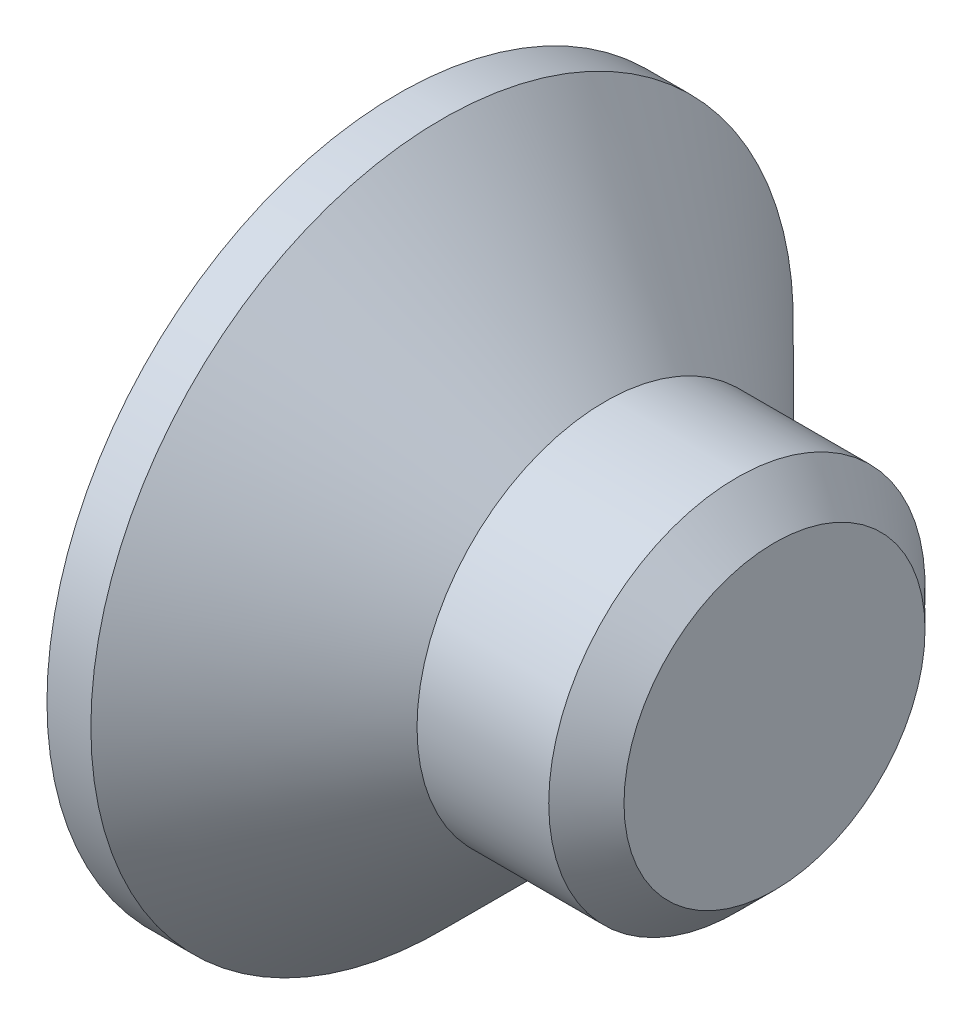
ISO-10303-21;
HEADER;
FILE_DESCRIPTION(('STEP AP214'),'2;1');
FILE_NAME('part.step','',(''),(''),'','','');
FILE_SCHEMA(('AUTOMOTIVE_DESIGN { 1 0 10303 214 1 1 1 1 }'));
ENDSEC;
DATA;
#1=APPLICATION_CONTEXT('core data for automotive mechanical design processes');
#2=APPLICATION_PROTOCOL_DEFINITION('international standard','automotive_design',2000,#1);
#3=PRODUCT_CONTEXT('',#1,'mechanical');
#4=PRODUCT('Part','Part','',(#3));
#5=PRODUCT_RELATED_PRODUCT_CATEGORY('part','',(#4));
#6=PRODUCT_DEFINITION_FORMATION('','',#4);
#7=PRODUCT_DEFINITION_CONTEXT('part definition',#1,'design');
#8=PRODUCT_DEFINITION('design','',#6,#7);
#9=PRODUCT_DEFINITION_SHAPE('','',#8);
#10=(LENGTH_UNIT() NAMED_UNIT(*) SI_UNIT(.MILLI.,.METRE.));
#11=(NAMED_UNIT(*) PLANE_ANGLE_UNIT() SI_UNIT($,.RADIAN.));
#12=(NAMED_UNIT(*) SI_UNIT($,.STERADIAN.) SOLID_ANGLE_UNIT());
#13=UNCERTAINTY_MEASURE_WITH_UNIT(LENGTH_MEASURE(1.E-05),#10,'distance_accuracy_value','');
#14=(GEOMETRIC_REPRESENTATION_CONTEXT(3) GLOBAL_UNCERTAINTY_ASSIGNED_CONTEXT((#13)) GLOBAL_UNIT_ASSIGNED_CONTEXT((#10,
#11,#12)) REPRESENTATION_CONTEXT('',''));
#15=CARTESIAN_POINT('',(0.,0.,0.));
#16=DIRECTION('',(0.,0.,1.));
#17=DIRECTION('',(1.,0.,0.));
#18=AXIS2_PLACEMENT_3D('',#15,#16,#17);
#19=CARTESIAN_POINT('',(0.,0.,0.));
#20=DIRECTION('',(-1.,0.,0.));
#21=DIRECTION('',(0.,0.,1.));
#22=AXIS2_PLACEMENT_3D('',#19,#20,#21);
#23=CONICAL_SURFACE('',#22,1.5,0.78539816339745);
#24=CARTESIAN_POINT('',(-1.3,0.,0.));
#25=DIRECTION('',(-1.,0.,0.));
#26=DIRECTION('',(0.,0.,1.));
#27=AXIS2_PLACEMENT_3D('',#24,#25,#26);
#28=CIRCLE('',#27,2.8);
#29=CARTESIAN_POINT('',(-1.3,0.,2.8));
#30=VERTEX_POINT('',#29);
#31=EDGE_CURVE('E189',#30,#30,#28,.T.);
#32=ORIENTED_EDGE('',*,*,#31,.F.);
#33=EDGE_LOOP('',(#32));
#34=FACE_BOUND('',#33,.T.);
#35=CARTESIAN_POINT('',(0.,0.,0.));
#36=DIRECTION('',(-1.,0.,0.));
#37=DIRECTION('',(0.,0.,1.));
#38=AXIS2_PLACEMENT_3D('',#35,#36,#37);
#39=CIRCLE('',#38,1.5);
#40=CARTESIAN_POINT('',(0.,0.,1.5));
#41=VERTEX_POINT('',#40);
#42=EDGE_CURVE('E212',#41,#41,#39,.T.);
#43=ORIENTED_EDGE('',*,*,#42,.T.);
#44=EDGE_LOOP('',(#43));
#45=FACE_BOUND('',#44,.T.);
#46=ADVANCED_FACE('F33',(#34,#45),#23,.T.);
#47=CARTESIAN_POINT('',(-1.65,0.,0.));
#48=DIRECTION('',(-1.,0.,0.));
#49=DIRECTION('',(0.,0.,1.));
#50=AXIS2_PLACEMENT_3D('',#47,#48,#49);
#51=CYLINDRICAL_SURFACE('',#50,1.5);
#52=CARTESIAN_POINT('',(1.05,0.,0.));
#53=DIRECTION('',(-1.,0.,0.));
#54=DIRECTION('',(0.,0.,1.));
#55=AXIS2_PLACEMENT_3D('',#52,#53,#54);
#56=CIRCLE('',#55,1.5);
#57=CARTESIAN_POINT('',(1.05,0.,1.5));
#58=VERTEX_POINT('',#57);
#59=EDGE_CURVE('E41',#58,#58,#56,.T.);
#60=ORIENTED_EDGE('',*,*,#59,.T.);
#61=EDGE_LOOP('',(#60));
#62=FACE_BOUND('',#61,.T.);
#63=ORIENTED_EDGE('',*,*,#42,.F.);
#64=EDGE_LOOP('',(#63));
#65=FACE_BOUND('',#64,.T.);
#66=ADVANCED_FACE('F217',(#62,#65),#51,.T.);
#67=CARTESIAN_POINT('',(1.35,0.,0.));
#68=DIRECTION('',(-1.,0.,0.));
#69=DIRECTION('',(0.,0.,1.));
#70=AXIS2_PLACEMENT_3D('',#67,#68,#69);
#71=PLANE('',#70);
#72=CARTESIAN_POINT('',(1.35,0.,0.));
#73=DIRECTION('',(-1.,0.,0.));
#74=DIRECTION('',(0.,0.,1.));
#75=AXIS2_PLACEMENT_3D('',#72,#73,#74);
#76=CIRCLE('',#75,1.2);
#77=CARTESIAN_POINT('',(1.35,0.,1.2));
#78=VERTEX_POINT('',#77);
#79=EDGE_CURVE('E11',#78,#78,#76,.F.);
#80=ORIENTED_EDGE('',*,*,#79,.T.);
#81=EDGE_LOOP('',(#80));
#82=FACE_BOUND('',#81,.T.);
#83=ADVANCED_FACE('F239',(#82),#71,.F.);
#84=CARTESIAN_POINT('',(-1.65,2.8,0.));
#85=DIRECTION('',(1.,0.,0.));
#86=DIRECTION('',(0.,0.,-1.));
#87=AXIS2_PLACEMENT_3D('',#84,#85,#86);
#88=PLANE('',#87);
#89=DIRECTION('',(0.,0.,-1.));
#90=VECTOR('',#89,1.);
#91=CARTESIAN_POINT('',(-1.65,0.365,-1.45));
#92=LINE('',#91,#90);
#93=CARTESIAN_POINT('',(-1.65,0.365,-0.365));
#94=VERTEX_POINT('',#93);
#95=CARTESIAN_POINT('',(-1.65,0.365,-1.45));
#96=VERTEX_POINT('',#95);
#97=EDGE_CURVE('E158',#94,#96,#92,.T.);
#98=ORIENTED_EDGE('',*,*,#97,.F.);
#99=DIRECTION('',(0.,-1.,0.));
#100=VECTOR('',#99,1.);
#101=CARTESIAN_POINT('',(-1.65,0.365,-0.365));
#102=LINE('',#101,#100);
#103=CARTESIAN_POINT('',(-1.65,1.45,-0.365));
#104=VERTEX_POINT('',#103);
#105=EDGE_CURVE('E48',#104,#94,#102,.T.);
#106=ORIENTED_EDGE('',*,*,#105,.F.);
#107=DIRECTION('',(0.,0.,-1.));
#108=VECTOR('',#107,1.);
#109=CARTESIAN_POINT('',(-1.65,1.45,-0.365));
#110=LINE('',#109,#108);
#111=CARTESIAN_POINT('',(-1.65,1.45,0.365));
#112=VERTEX_POINT('',#111);
#113=EDGE_CURVE('E185',#112,#104,#110,.T.);
#114=ORIENTED_EDGE('',*,*,#113,.F.);
#115=DIRECTION('',(0.,1.,0.));
#116=VECTOR('',#115,1.);
#117=CARTESIAN_POINT('',(-1.65,1.45,0.365));
#118=LINE('',#117,#116);
#119=CARTESIAN_POINT('',(-1.65,0.365,0.365));
#120=VERTEX_POINT('',#119);
#121=EDGE_CURVE('E183',#120,#112,#118,.T.);
#122=ORIENTED_EDGE('',*,*,#121,.F.);
#123=DIRECTION('',(0.,0.,-1.));
#124=VECTOR('',#123,1.);
#125=CARTESIAN_POINT('',(-1.65,0.365,0.365));
#126=LINE('',#125,#124);
#127=CARTESIAN_POINT('',(-1.65,0.365,1.45));
#128=VERTEX_POINT('',#127);
#129=EDGE_CURVE('E132',#128,#120,#126,.T.);
#130=ORIENTED_EDGE('',*,*,#129,.F.);
#131=DIRECTION('',(0.,1.,0.));
#132=VECTOR('',#131,1.);
#133=CARTESIAN_POINT('',(-1.65,0.365,1.45));
#134=LINE('',#133,#132);
#135=CARTESIAN_POINT('',(-1.65,-0.365,1.45));
#136=VERTEX_POINT('',#135);
#137=EDGE_CURVE('E179',#136,#128,#134,.T.);
#138=ORIENTED_EDGE('',*,*,#137,.F.);
#139=DIRECTION('',(0.,0.,1.));
#140=VECTOR('',#139,1.);
#141=CARTESIAN_POINT('',(-1.65,-0.365,1.45));
#142=LINE('',#141,#140);
#143=CARTESIAN_POINT('',(-1.65,-0.365,0.365));
#144=VERTEX_POINT('',#143);
#145=EDGE_CURVE('E176',#144,#136,#142,.T.);
#146=ORIENTED_EDGE('',*,*,#145,.F.);
#147=DIRECTION('',(0.,1.,0.));
#148=VECTOR('',#147,1.);
#149=CARTESIAN_POINT('',(-1.65,-0.365,0.365));
#150=LINE('',#149,#148);
#151=CARTESIAN_POINT('',(-1.65,-1.45,0.365));
#152=VERTEX_POINT('',#151);
#153=EDGE_CURVE('E173',#152,#144,#150,.T.);
#154=ORIENTED_EDGE('',*,*,#153,.F.);
#155=DIRECTION('',(0.,0.,1.));
#156=VECTOR('',#155,1.);
#157=CARTESIAN_POINT('',(-1.65,-1.45,0.365));
#158=LINE('',#157,#156);
#159=CARTESIAN_POINT('',(-1.65,-1.45,-0.365));
#160=VERTEX_POINT('',#159);
#161=EDGE_CURVE('E170',#160,#152,#158,.T.);
#162=ORIENTED_EDGE('',*,*,#161,.F.);
#163=DIRECTION('',(0.,-1.,0.));
#164=VECTOR('',#163,1.);
#165=CARTESIAN_POINT('',(-1.65,-1.45,-0.365));
#166=LINE('',#165,#164);
#167=CARTESIAN_POINT('',(-1.65,-0.365,-0.365));
#168=VERTEX_POINT('',#167);
#169=EDGE_CURVE('E167',#168,#160,#166,.T.);
#170=ORIENTED_EDGE('',*,*,#169,.F.);
#171=DIRECTION('',(0.,0.,1.));
#172=VECTOR('',#171,1.);
#173=CARTESIAN_POINT('',(-1.65,-0.365,-0.365));
#174=LINE('',#173,#172);
#175=CARTESIAN_POINT('',(-1.65,-0.365,-1.45));
#176=VERTEX_POINT('',#175);
#177=EDGE_CURVE('E164',#176,#168,#174,.T.);
#178=ORIENTED_EDGE('',*,*,#177,.F.);
#179=DIRECTION('',(0.,-1.,0.));
#180=VECTOR('',#179,1.);
#181=CARTESIAN_POINT('',(-1.65,-0.365,-1.45));
#182=LINE('',#181,#180);
#183=EDGE_CURVE('E161',#96,#176,#182,.T.);
#184=ORIENTED_EDGE('',*,*,#183,.F.);
#185=EDGE_LOOP('',(#98,#106,#114,#122,#130,#138,#146,#154,#162,#170,#178,#184));
#186=FACE_BOUND('',#185,.T.);
#187=CARTESIAN_POINT('',(-1.65,0.,0.));
#188=DIRECTION('',(-1.,0.,0.));
#189=DIRECTION('',(0.,0.,1.));
#190=AXIS2_PLACEMENT_3D('',#187,#188,#189);
#191=CIRCLE('',#190,2.8);
#192=CARTESIAN_POINT('',(-1.65,0.,2.8));
#193=VERTEX_POINT('',#192);
#194=EDGE_CURVE('E209',#193,#193,#191,.T.);
#195=ORIENTED_EDGE('',*,*,#194,.T.);
#196=EDGE_LOOP('',(#195));
#197=FACE_BOUND('',#196,.T.);
#198=ADVANCED_FACE('F230',(#186,#197),#88,.F.);
#199=CARTESIAN_POINT('',(-1.65,0.,0.));
#200=DIRECTION('',(-1.,0.,0.));
#201=DIRECTION('',(0.,0.,1.));
#202=AXIS2_PLACEMENT_3D('',#199,#200,#201);
#203=CYLINDRICAL_SURFACE('',#202,2.8);
#204=ORIENTED_EDGE('',*,*,#194,.F.);
#205=EDGE_LOOP('',(#204));
#206=FACE_BOUND('',#205,.T.);
#207=ORIENTED_EDGE('',*,*,#31,.T.);
#208=EDGE_LOOP('',(#207));
#209=FACE_BOUND('',#208,.T.);
#210=ADVANCED_FACE('F222',(#206,#209),#203,.T.);
#211=CARTESIAN_POINT('',(1.05,0.,0.));
#212=DIRECTION('',(-1.,0.,0.));
#213=DIRECTION('',(0.,0.,1.));
#214=AXIS2_PLACEMENT_3D('',#211,#212,#213);
#215=CONICAL_SURFACE('',#214,1.5,0.78539816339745);
#216=CARTESIAN_POINT('',(1.35,0.,1.2));
#217=CARTESIAN_POINT('',(1.346875,0.,1.203125));
#218=CARTESIAN_POINT('',(1.34375,0.,1.20625));
#219=CARTESIAN_POINT('',(1.3375,0.,1.2125));
#220=CARTESIAN_POINT('',(1.334375,0.,1.215625));
#221=CARTESIAN_POINT('',(1.328125,0.,1.221875));
#222=CARTESIAN_POINT('',(1.325,0.,1.225));
#223=CARTESIAN_POINT('',(1.31875,0.,1.23125));
#224=CARTESIAN_POINT('',(1.315625,0.,1.234375));
#225=CARTESIAN_POINT('',(1.309375,0.,1.240625));
#226=CARTESIAN_POINT('',(1.30625,0.,1.24375));
#227=CARTESIAN_POINT('',(1.3,0.,1.25));
#228=CARTESIAN_POINT('',(1.296875,0.,1.253125));
#229=CARTESIAN_POINT('',(1.290625,0.,1.259375));
#230=CARTESIAN_POINT('',(1.2875,0.,1.2625));
#231=CARTESIAN_POINT('',(1.28125,0.,1.26875));
#232=CARTESIAN_POINT('',(1.278125,0.,1.271875));
#233=CARTESIAN_POINT('',(1.271875,0.,1.278125));
#234=CARTESIAN_POINT('',(1.26875,0.,1.28125));
#235=CARTESIAN_POINT('',(1.2625,0.,1.2875));
#236=CARTESIAN_POINT('',(1.259375,0.,1.290625));
#237=CARTESIAN_POINT('',(1.253125,0.,1.296875));
#238=CARTESIAN_POINT('',(1.25,0.,1.3));
#239=CARTESIAN_POINT('',(1.24375,0.,1.30625));
#240=CARTESIAN_POINT('',(1.240625,0.,1.309375));
#241=CARTESIAN_POINT('',(1.234375,0.,1.315625));
#242=CARTESIAN_POINT('',(1.23125,0.,1.31875));
#243=CARTESIAN_POINT('',(1.225,0.,1.325));
#244=CARTESIAN_POINT('',(1.221875,0.,1.328125));
#245=CARTESIAN_POINT('',(1.215625,0.,1.334375));
#246=CARTESIAN_POINT('',(1.2125,0.,1.3375));
#247=CARTESIAN_POINT('',(1.20625,0.,1.34375));
#248=CARTESIAN_POINT('',(1.203125,0.,1.346875));
#249=CARTESIAN_POINT('',(1.196875,0.,1.353125));
#250=CARTESIAN_POINT('',(1.19375,0.,1.35625));
#251=CARTESIAN_POINT('',(1.1875,0.,1.3625));
#252=CARTESIAN_POINT('',(1.184375,0.,1.365625));
#253=CARTESIAN_POINT('',(1.178125,0.,1.371875));
#254=CARTESIAN_POINT('',(1.175,0.,1.375));
#255=CARTESIAN_POINT('',(1.16875,0.,1.38125));
#256=CARTESIAN_POINT('',(1.165625,0.,1.384375));
#257=CARTESIAN_POINT('',(1.159375,0.,1.390625));
#258=CARTESIAN_POINT('',(1.15625,0.,1.39375));
#259=CARTESIAN_POINT('',(1.15,0.,1.4));
#260=CARTESIAN_POINT('',(1.146875,0.,1.403125));
#261=CARTESIAN_POINT('',(1.140625,0.,1.409375));
#262=CARTESIAN_POINT('',(1.1375,0.,1.4125));
#263=CARTESIAN_POINT('',(1.13125,0.,1.41875));
#264=CARTESIAN_POINT('',(1.128125,0.,1.421875));
#265=CARTESIAN_POINT('',(1.121875,0.,1.428125));
#266=CARTESIAN_POINT('',(1.11875,0.,1.43125));
#267=CARTESIAN_POINT('',(1.1125,0.,1.4375));
#268=CARTESIAN_POINT('',(1.109375,0.,1.440625));
#269=CARTESIAN_POINT('',(1.103125,0.,1.446875));
#270=CARTESIAN_POINT('',(1.1,0.,1.45));
#271=CARTESIAN_POINT('',(1.09375,0.,1.45625));
#272=CARTESIAN_POINT('',(1.090625,0.,1.459375));
#273=CARTESIAN_POINT('',(1.084375,0.,1.465625));
#274=CARTESIAN_POINT('',(1.08125,0.,1.46875));
#275=CARTESIAN_POINT('',(1.075,0.,1.475));
#276=CARTESIAN_POINT('',(1.071875,0.,1.478125));
#277=CARTESIAN_POINT('',(1.065625,0.,1.484375));
#278=CARTESIAN_POINT('',(1.0625,0.,1.4875));
#279=CARTESIAN_POINT('',(1.05625,0.,1.49375));
#280=CARTESIAN_POINT('',(1.053125,0.,1.496875));
#281=CARTESIAN_POINT('',(1.05,0.,1.5));
#282=B_SPLINE_CURVE_WITH_KNOTS('',3,(#216,#217,#218,#219,#220,#221,#222,#223,#224,#225,#226,
#227,#228,#229,#230,#231,#232,#233,#234,#235,#236,#237,#238,#239,#240,#241,#242,#243,#244,#245,
#246,#247,#248,#249,#250,#251,#252,#253,#254,#255,#256,#257,#258,#259,#260,#261,#262,#263,#264,
#265,#266,#267,#268,#269,#270,#271,#272,#273,#274,#275,#276,#277,#278,#279,#280,#281),
.UNSPECIFIED.,.F.,.F.,(4,2,2,2,2,2,2,2,2,2,2,2,2,2,2,2,2,2,2,2,2,2,2,2,2,2,2,2,2,2,2,2,4),(0.,
0.0132582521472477,0.0265165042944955,0.0397747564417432,0.053033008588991,0.0662912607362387,
0.0795495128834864,0.0928077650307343,0.106066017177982,0.11932426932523,0.132582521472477,
0.145840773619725,0.159099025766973,0.17235727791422,0.185615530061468,0.198873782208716,
0.212132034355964,0.225390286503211,0.238648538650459,0.251906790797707,0.265165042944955,
0.278423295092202,0.29168154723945,0.304939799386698,0.318198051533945,0.331456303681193,
0.344714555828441,0.357972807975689,0.371231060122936,0.384489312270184,0.397747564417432,
0.411005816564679,0.424264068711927),.UNSPECIFIED.);
#283=EDGE_CURVE('BSEAM35',#78,#58,#282,.T.);
#284=ORIENTED_EDGE('',*,*,#79,.F.);
#285=ORIENTED_EDGE('',*,*,#59,.F.);
#286=ORIENTED_EDGE('',*,*,#283,.T.);
#287=ORIENTED_EDGE('',*,*,#283,.F.);
#288=EDGE_LOOP('',(#284,#286,#285,#287));
#289=FACE_BOUND('',#288,.T.);
#290=ADVANCED_FACE('F35',(#289),#215,.T.);
#291=CARTESIAN_POINT('',(-0.4,0.365,-0.365));
#292=DIRECTION('',(0.,0.,-1.));
#293=DIRECTION('',(-1.,0.,0.));
#294=AXIS2_PLACEMENT_3D('',#291,#292,#293);
#295=PLANE('',#294);
#296=ORIENTED_EDGE('',*,*,#105,.T.);
#297=DIRECTION('',(-1.,0.,0.));
#298=VECTOR('',#297,1.);
#299=CARTESIAN_POINT('',(-0.4,0.365,-0.365));
#300=LINE('',#299,#298);
#301=CARTESIAN_POINT('',(-0.4,0.365,-0.365));
#302=VERTEX_POINT('',#301);
#303=EDGE_CURVE('E96',#302,#94,#300,.T.);
#304=ORIENTED_EDGE('',*,*,#303,.F.);
#305=DIRECTION('',(0.,-1.,0.));
#306=VECTOR('',#305,1.);
#307=CARTESIAN_POINT('',(-0.4,0.365,-0.365));
#308=LINE('',#307,#306);
#309=CARTESIAN_POINT('',(-0.4,1.45,-0.365));
#310=VERTEX_POINT('',#309);
#311=EDGE_CURVE('E187',#310,#302,#308,.T.);
#312=ORIENTED_EDGE('',*,*,#311,.F.);
#313=DIRECTION('',(-1.,0.,0.));
#314=VECTOR('',#313,1.);
#315=CARTESIAN_POINT('',(-0.4,1.45,-0.365));
#316=LINE('',#315,#314);
#317=EDGE_CURVE('E56',#310,#104,#316,.T.);
#318=ORIENTED_EDGE('',*,*,#317,.T.);
#319=EDGE_LOOP('',(#296,#304,#312,#318));
#320=FACE_BOUND('',#319,.T.);
#321=ADVANCED_FACE('F221',(#320),#295,.F.);
#322=CARTESIAN_POINT('',(-0.4,1.45,-0.365));
#323=DIRECTION('',(0.,1.,0.));
#324=DIRECTION('',(-1.,0.,0.));
#325=AXIS2_PLACEMENT_3D('',#322,#323,#324);
#326=PLANE('',#325);
#327=ORIENTED_EDGE('',*,*,#113,.T.);
#328=ORIENTED_EDGE('',*,*,#317,.F.);
#329=DIRECTION('',(0.,0.,-1.));
#330=VECTOR('',#329,1.);
#331=CARTESIAN_POINT('',(-0.4,1.45,-0.365));
#332=LINE('',#331,#330);
#333=CARTESIAN_POINT('',(-0.4,1.45,0.365));
#334=VERTEX_POINT('',#333);
#335=EDGE_CURVE('E144',#334,#310,#332,.T.);
#336=ORIENTED_EDGE('',*,*,#335,.F.);
#337=DIRECTION('',(-1.,0.,0.));
#338=VECTOR('',#337,1.);
#339=CARTESIAN_POINT('',(-0.4,1.45,0.365));
#340=LINE('',#339,#338);
#341=EDGE_CURVE('E136',#334,#112,#340,.T.);
#342=ORIENTED_EDGE('',*,*,#341,.T.);
#343=EDGE_LOOP('',(#327,#328,#336,#342));
#344=FACE_BOUND('',#343,.T.);
#345=ADVANCED_FACE('F228',(#344),#326,.F.);
#346=CARTESIAN_POINT('',(-0.4,1.45,0.365));
#347=DIRECTION('',(0.,0.,1.));
#348=DIRECTION('',(1.,0.,0.));
#349=AXIS2_PLACEMENT_3D('',#346,#347,#348);
#350=PLANE('',#349);
#351=ORIENTED_EDGE('',*,*,#121,.T.);
#352=ORIENTED_EDGE('',*,*,#341,.F.);
#353=DIRECTION('',(0.,1.,0.));
#354=VECTOR('',#353,1.);
#355=CARTESIAN_POINT('',(-0.4,1.45,0.365));
#356=LINE('',#355,#354);
#357=CARTESIAN_POINT('',(-0.4,0.365,0.365));
#358=VERTEX_POINT('',#357);
#359=EDGE_CURVE('E140',#358,#334,#356,.T.);
#360=ORIENTED_EDGE('',*,*,#359,.F.);
#361=DIRECTION('',(-1.,0.,0.));
#362=VECTOR('',#361,1.);
#363=CARTESIAN_POINT('',(-0.4,0.365,0.365));
#364=LINE('',#363,#362);
#365=EDGE_CURVE('E125',#358,#120,#364,.T.);
#366=ORIENTED_EDGE('',*,*,#365,.T.);
#367=EDGE_LOOP('',(#351,#352,#360,#366));
#368=FACE_BOUND('',#367,.T.);
#369=ADVANCED_FACE('F141',(#368),#350,.F.);
#370=CARTESIAN_POINT('',(-0.4,0.365,0.365));
#371=DIRECTION('',(0.,1.,0.));
#372=DIRECTION('',(-1.,0.,0.));
#373=AXIS2_PLACEMENT_3D('',#370,#371,#372);
#374=PLANE('',#373);
#375=ORIENTED_EDGE('',*,*,#129,.T.);
#376=ORIENTED_EDGE('',*,*,#365,.F.);
#377=DIRECTION('',(0.,0.,-1.));
#378=VECTOR('',#377,1.);
#379=CARTESIAN_POINT('',(-0.4,0.365,0.365));
#380=LINE('',#379,#378);
#381=CARTESIAN_POINT('',(-0.4,0.365,1.45));
#382=VERTEX_POINT('',#381);
#383=EDGE_CURVE('E129',#382,#358,#380,.T.);
#384=ORIENTED_EDGE('',*,*,#383,.F.);
#385=DIRECTION('',(-1.,0.,0.));
#386=VECTOR('',#385,1.);
#387=CARTESIAN_POINT('',(-0.4,0.365,1.45));
#388=LINE('',#387,#386);
#389=EDGE_CURVE('E137',#382,#128,#388,.T.);
#390=ORIENTED_EDGE('',*,*,#389,.T.);
#391=EDGE_LOOP('',(#375,#376,#384,#390));
#392=FACE_BOUND('',#391,.T.);
#393=ADVANCED_FACE('F127',(#392),#374,.F.);
#394=CARTESIAN_POINT('',(-0.4,0.365,1.45));
#395=DIRECTION('',(0.,0.,1.));
#396=DIRECTION('',(1.,0.,0.));
#397=AXIS2_PLACEMENT_3D('',#394,#395,#396);
#398=PLANE('',#397);
#399=ORIENTED_EDGE('',*,*,#137,.T.);
#400=ORIENTED_EDGE('',*,*,#389,.F.);
#401=DIRECTION('',(0.,1.,0.));
#402=VECTOR('',#401,1.);
#403=CARTESIAN_POINT('',(-0.4,0.365,1.45));
#404=LINE('',#403,#402);
#405=CARTESIAN_POINT('',(-0.4,-0.365,1.45));
#406=VERTEX_POINT('',#405);
#407=EDGE_CURVE('E150',#406,#382,#404,.T.);
#408=ORIENTED_EDGE('',*,*,#407,.F.);
#409=DIRECTION('',(-1.,0.,0.));
#410=VECTOR('',#409,1.);
#411=CARTESIAN_POINT('',(-0.4,-0.365,1.45));
#412=LINE('',#411,#410);
#413=EDGE_CURVE('E192',#406,#136,#412,.T.);
#414=ORIENTED_EDGE('',*,*,#413,.T.);
#415=EDGE_LOOP('',(#399,#400,#408,#414));
#416=FACE_BOUND('',#415,.T.);
#417=ADVANCED_FACE('F277',(#416),#398,.F.);
#418=CARTESIAN_POINT('',(-0.4,-0.365,1.45));
#419=DIRECTION('',(0.,-1.,0.));
#420=DIRECTION('',(1.,0.,0.));
#421=AXIS2_PLACEMENT_3D('',#418,#419,#420);
#422=PLANE('',#421);
#423=ORIENTED_EDGE('',*,*,#145,.T.);
#424=ORIENTED_EDGE('',*,*,#413,.F.);
#425=DIRECTION('',(0.,0.,1.));
#426=VECTOR('',#425,1.);
#427=CARTESIAN_POINT('',(-0.4,-0.365,1.45));
#428=LINE('',#427,#426);
#429=CARTESIAN_POINT('',(-0.4,-0.365,0.365));
#430=VERTEX_POINT('',#429);
#431=EDGE_CURVE('E152',#430,#406,#428,.T.);
#432=ORIENTED_EDGE('',*,*,#431,.F.);
#433=DIRECTION('',(-1.,0.,0.));
#434=VECTOR('',#433,1.);
#435=CARTESIAN_POINT('',(-0.4,-0.365,0.365));
#436=LINE('',#435,#434);
#437=EDGE_CURVE('E194',#430,#144,#436,.T.);
#438=ORIENTED_EDGE('',*,*,#437,.T.);
#439=EDGE_LOOP('',(#423,#424,#432,#438));
#440=FACE_BOUND('',#439,.T.);
#441=ADVANCED_FACE('F273',(#440),#422,.F.);
#442=CARTESIAN_POINT('',(-0.4,-0.365,0.365));
#443=DIRECTION('',(0.,0.,1.));
#444=DIRECTION('',(1.,0.,0.));
#445=AXIS2_PLACEMENT_3D('',#442,#443,#444);
#446=PLANE('',#445);
#447=ORIENTED_EDGE('',*,*,#153,.T.);
#448=ORIENTED_EDGE('',*,*,#437,.F.);
#449=DIRECTION('',(0.,1.,0.));
#450=VECTOR('',#449,1.);
#451=CARTESIAN_POINT('',(-0.4,-0.365,0.365));
#452=LINE('',#451,#450);
#453=CARTESIAN_POINT('',(-0.4,-1.45,0.365));
#454=VERTEX_POINT('',#453);
#455=EDGE_CURVE('E422',#454,#430,#452,.T.);
#456=ORIENTED_EDGE('',*,*,#455,.F.);
#457=DIRECTION('',(-1.,0.,0.));
#458=VECTOR('',#457,1.);
#459=CARTESIAN_POINT('',(-0.4,-1.45,0.365));
#460=LINE('',#459,#458);
#461=EDGE_CURVE('E196',#454,#152,#460,.T.);
#462=ORIENTED_EDGE('',*,*,#461,.T.);
#463=EDGE_LOOP('',(#447,#448,#456,#462));
#464=FACE_BOUND('',#463,.T.);
#465=ADVANCED_FACE('F269',(#464),#446,.F.);
#466=CARTESIAN_POINT('',(-0.4,-1.45,0.365));
#467=DIRECTION('',(0.,-1.,0.));
#468=DIRECTION('',(1.,0.,0.));
#469=AXIS2_PLACEMENT_3D('',#466,#467,#468);
#470=PLANE('',#469);
#471=ORIENTED_EDGE('',*,*,#161,.T.);
#472=ORIENTED_EDGE('',*,*,#461,.F.);
#473=DIRECTION('',(0.,0.,1.));
#474=VECTOR('',#473,1.);
#475=CARTESIAN_POINT('',(-0.4,-1.45,0.365));
#476=LINE('',#475,#474);
#477=CARTESIAN_POINT('',(-0.4,-1.45,-0.365));
#478=VERTEX_POINT('',#477);
#479=EDGE_CURVE('E419',#478,#454,#476,.T.);
#480=ORIENTED_EDGE('',*,*,#479,.F.);
#481=DIRECTION('',(-1.,0.,0.));
#482=VECTOR('',#481,1.);
#483=CARTESIAN_POINT('',(-0.4,-1.45,-0.365));
#484=LINE('',#483,#482);
#485=EDGE_CURVE('E198',#478,#160,#484,.T.);
#486=ORIENTED_EDGE('',*,*,#485,.T.);
#487=EDGE_LOOP('',(#471,#472,#480,#486));
#488=FACE_BOUND('',#487,.T.);
#489=ADVANCED_FACE('F265',(#488),#470,.F.);
#490=CARTESIAN_POINT('',(-0.4,-1.45,-0.365));
#491=DIRECTION('',(0.,0.,-1.));
#492=DIRECTION('',(-1.,0.,0.));
#493=AXIS2_PLACEMENT_3D('',#490,#491,#492);
#494=PLANE('',#493);
#495=ORIENTED_EDGE('',*,*,#169,.T.);
#496=ORIENTED_EDGE('',*,*,#485,.F.);
#497=DIRECTION('',(0.,-1.,0.));
#498=VECTOR('',#497,1.);
#499=CARTESIAN_POINT('',(-0.4,-1.45,-0.365));
#500=LINE('',#499,#498);
#501=CARTESIAN_POINT('',(-0.4,-0.365,-0.365));
#502=VERTEX_POINT('',#501);
#503=EDGE_CURVE('E416',#502,#478,#500,.T.);
#504=ORIENTED_EDGE('',*,*,#503,.F.);
#505=DIRECTION('',(-1.,0.,0.));
#506=VECTOR('',#505,1.);
#507=CARTESIAN_POINT('',(-0.4,-0.365,-0.365));
#508=LINE('',#507,#506);
#509=EDGE_CURVE('E200',#502,#168,#508,.T.);
#510=ORIENTED_EDGE('',*,*,#509,.T.);
#511=EDGE_LOOP('',(#495,#496,#504,#510));
#512=FACE_BOUND('',#511,.T.);
#513=ADVANCED_FACE('F261',(#512),#494,.F.);
#514=CARTESIAN_POINT('',(-0.4,-0.365,-0.365));
#515=DIRECTION('',(0.,-1.,0.));
#516=DIRECTION('',(1.,0.,0.));
#517=AXIS2_PLACEMENT_3D('',#514,#515,#516);
#518=PLANE('',#517);
#519=ORIENTED_EDGE('',*,*,#177,.T.);
#520=ORIENTED_EDGE('',*,*,#509,.F.);
#521=DIRECTION('',(0.,0.,1.));
#522=VECTOR('',#521,1.);
#523=CARTESIAN_POINT('',(-0.4,-0.365,-0.365));
#524=LINE('',#523,#522);
#525=CARTESIAN_POINT('',(-0.4,-0.365,-1.45));
#526=VERTEX_POINT('',#525);
#527=EDGE_CURVE('E413',#526,#502,#524,.T.);
#528=ORIENTED_EDGE('',*,*,#527,.F.);
#529=DIRECTION('',(-1.,0.,0.));
#530=VECTOR('',#529,1.);
#531=CARTESIAN_POINT('',(-0.4,-0.365,-1.45));
#532=LINE('',#531,#530);
#533=EDGE_CURVE('E202',#526,#176,#532,.T.);
#534=ORIENTED_EDGE('',*,*,#533,.T.);
#535=EDGE_LOOP('',(#519,#520,#528,#534));
#536=FACE_BOUND('',#535,.T.);
#537=ADVANCED_FACE('F257',(#536),#518,.F.);
#538=CARTESIAN_POINT('',(-0.4,-0.365,-1.45));
#539=DIRECTION('',(0.,0.,-1.));
#540=DIRECTION('',(-1.,0.,0.));
#541=AXIS2_PLACEMENT_3D('',#538,#539,#540);
#542=PLANE('',#541);
#543=ORIENTED_EDGE('',*,*,#183,.T.);
#544=ORIENTED_EDGE('',*,*,#533,.F.);
#545=DIRECTION('',(0.,-1.,0.));
#546=VECTOR('',#545,1.);
#547=CARTESIAN_POINT('',(-0.4,-0.365,-1.45));
#548=LINE('',#547,#546);
#549=CARTESIAN_POINT('',(-0.4,0.365,-1.45));
#550=VERTEX_POINT('',#549);
#551=EDGE_CURVE('E408',#550,#526,#548,.T.);
#552=ORIENTED_EDGE('',*,*,#551,.F.);
#553=DIRECTION('',(-1.,0.,0.));
#554=VECTOR('',#553,1.);
#555=CARTESIAN_POINT('',(-0.4,0.365,-1.45));
#556=LINE('',#555,#554);
#557=EDGE_CURVE('E204',#550,#96,#556,.T.);
#558=ORIENTED_EDGE('',*,*,#557,.T.);
#559=EDGE_LOOP('',(#543,#544,#552,#558));
#560=FACE_BOUND('',#559,.T.);
#561=ADVANCED_FACE('F253',(#560),#542,.F.);
#562=CARTESIAN_POINT('',(-0.4,0.365,-1.45));
#563=DIRECTION('',(0.,1.,0.));
#564=DIRECTION('',(-1.,0.,0.));
#565=AXIS2_PLACEMENT_3D('',#562,#563,#564);
#566=PLANE('',#565);
#567=ORIENTED_EDGE('',*,*,#97,.T.);
#568=ORIENTED_EDGE('',*,*,#557,.F.);
#569=DIRECTION('',(0.,0.,-1.));
#570=VECTOR('',#569,1.);
#571=CARTESIAN_POINT('',(-0.4,0.365,-1.45));
#572=LINE('',#571,#570);
#573=EDGE_CURVE('E406',#302,#550,#572,.T.);
#574=ORIENTED_EDGE('',*,*,#573,.F.);
#575=ORIENTED_EDGE('',*,*,#303,.T.);
#576=EDGE_LOOP('',(#567,#568,#574,#575));
#577=FACE_BOUND('',#576,.T.);
#578=ADVANCED_FACE('F250',(#577),#566,.F.);
#579=CARTESIAN_POINT('',(-0.4,0.,0.));
#580=DIRECTION('',(1.,0.,0.));
#581=DIRECTION('',(0.,0.,-1.));
#582=AXIS2_PLACEMENT_3D('',#579,#580,#581);
#583=PLANE('',#582);
#584=ORIENTED_EDGE('',*,*,#311,.T.);
#585=ORIENTED_EDGE('',*,*,#573,.T.);
#586=ORIENTED_EDGE('',*,*,#551,.T.);
#587=ORIENTED_EDGE('',*,*,#527,.T.);
#588=ORIENTED_EDGE('',*,*,#503,.T.);
#589=ORIENTED_EDGE('',*,*,#479,.T.);
#590=ORIENTED_EDGE('',*,*,#455,.T.);
#591=ORIENTED_EDGE('',*,*,#431,.T.);
#592=ORIENTED_EDGE('',*,*,#407,.T.);
#593=ORIENTED_EDGE('',*,*,#383,.T.);
#594=ORIENTED_EDGE('',*,*,#359,.T.);
#595=ORIENTED_EDGE('',*,*,#335,.T.);
#596=EDGE_LOOP('',(#584,#585,#586,#587,#588,#589,#590,#591,#592,#593,#594,#595));
#597=FACE_BOUND('',#596,.T.);
#598=ADVANCED_FACE('F147',(#597),#583,.F.);
#599=CLOSED_SHELL('',(#46,#66,#83,#198,#210,#290,#321,#345,#369,#393,#417,#441,#465,#489,#513,
#537,#561,#578,#598));
#600=MANIFOLD_SOLID_BREP('B2',#599);
#601=ADVANCED_BREP_SHAPE_REPRESENTATION('',(#18,#600),#14);
#602=SHAPE_DEFINITION_REPRESENTATION(#9,#601);
ENDSEC;
END-ISO-10303-21;
